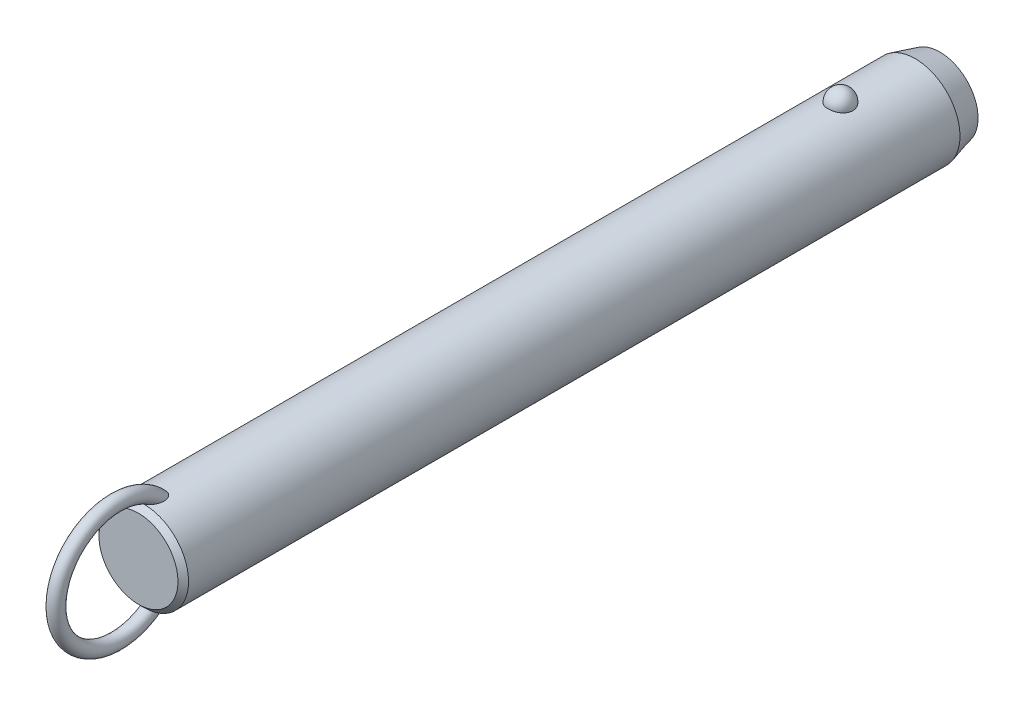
ISO-10303-21;
HEADER;
FILE_DESCRIPTION(('STEP AP214'),'2;1');
FILE_NAME('part.step','',(''),(''),'','','');
FILE_SCHEMA(('AUTOMOTIVE_DESIGN { 1 0 10303 214 1 1 1 1 }'));
ENDSEC;
DATA;
#1=APPLICATION_CONTEXT('core data for automotive mechanical design processes');
#2=APPLICATION_PROTOCOL_DEFINITION('international standard','automotive_design',2000,#1);
#3=PRODUCT_CONTEXT('',#1,'mechanical');
#4=PRODUCT('Part','Part','',(#3));
#5=PRODUCT_RELATED_PRODUCT_CATEGORY('part','',(#4));
#6=PRODUCT_DEFINITION_FORMATION('','',#4);
#7=PRODUCT_DEFINITION_CONTEXT('part definition',#1,'design');
#8=PRODUCT_DEFINITION('design','',#6,#7);
#9=PRODUCT_DEFINITION_SHAPE('','',#8);
#10=(LENGTH_UNIT() NAMED_UNIT(*) SI_UNIT(.MILLI.,.METRE.));
#11=(NAMED_UNIT(*) PLANE_ANGLE_UNIT() SI_UNIT($,.RADIAN.));
#12=(NAMED_UNIT(*) SI_UNIT($,.STERADIAN.) SOLID_ANGLE_UNIT());
#13=UNCERTAINTY_MEASURE_WITH_UNIT(LENGTH_MEASURE(1.E-05),#10,'distance_accuracy_value','');
#14=(GEOMETRIC_REPRESENTATION_CONTEXT(3) GLOBAL_UNCERTAINTY_ASSIGNED_CONTEXT((#13)) GLOBAL_UNIT_ASSIGNED_CONTEXT((#10,
#11,#12)) REPRESENTATION_CONTEXT('',''));
#15=CARTESIAN_POINT('',(0.,0.,0.));
#16=DIRECTION('',(0.,0.,1.));
#17=DIRECTION('',(1.,0.,0.));
#18=AXIS2_PLACEMENT_3D('',#15,#16,#17);
#19=CARTESIAN_POINT('',(0.,0.,182.9));
#20=DIRECTION('',(0.,0.,-1.));
#21=DIRECTION('',(-1.,0.,0.));
#22=AXIS2_PLACEMENT_3D('',#19,#20,#21);
#23=CYLINDRICAL_SURFACE('',#22,12.7);
#24=CARTESIAN_POINT('',(3.46661256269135,12.2177165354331,-3.5));
#25=CARTESIAN_POINT('',(3.4666090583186,12.2177194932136,-3.30432790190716));
#26=CARTESIAN_POINT('',(3.45063567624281,12.2222841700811,-3.10861112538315));
#27=CARTESIAN_POINT('',(3.38712451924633,12.2400345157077,-2.72271899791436));
#28=CARTESIAN_POINT('',(3.33957415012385,12.2532236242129,-2.53254588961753));
#29=CARTESIAN_POINT('',(3.2141234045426,12.286724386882,-2.16324948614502));
#30=CARTESIAN_POINT('',(3.13623639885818,12.3070329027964,-1.98412136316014));
#31=CARTESIAN_POINT('',(2.95205930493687,12.3525018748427,-1.64180592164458));
#32=CARTESIAN_POINT('',(2.84577003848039,12.3776621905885,-1.47861814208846));
#33=CARTESIAN_POINT('',(2.60688050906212,12.4301712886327,-1.17190583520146));
#34=CARTESIAN_POINT('',(2.47415697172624,12.4575299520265,-1.02847897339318));
#35=CARTESIAN_POINT('',(2.18615174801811,12.5112810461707,-0.766177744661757));
#36=CARTESIAN_POINT('',(2.03087002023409,12.5376734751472,-0.647303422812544));
#37=CARTESIAN_POINT('',(1.70237334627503,12.5864761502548,-0.437732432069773));
#38=CARTESIAN_POINT('',(1.52920948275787,12.6088972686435,-0.34695830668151));
#39=CARTESIAN_POINT('',(1.16944170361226,12.6473352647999,-0.195750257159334));
#40=CARTESIAN_POINT('',(0.982839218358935,12.663352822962,-0.135313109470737));
#41=CARTESIAN_POINT('',(0.604961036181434,12.6869706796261,-0.0473241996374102));
#42=CARTESIAN_POINT('',(0.413823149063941,12.6947125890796,-0.0192185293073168));
#43=CARTESIAN_POINT('',(0.0293827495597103,12.7014203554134,0.00517254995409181));
#44=CARTESIAN_POINT('',(-0.163919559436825,12.7003870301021,0.00146092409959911));
#45=CARTESIAN_POINT('',(-0.544374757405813,12.689735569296,-0.0373939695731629));
#46=CARTESIAN_POINT('',(-0.731575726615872,12.6802364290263,-0.0721015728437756));
#47=CARTESIAN_POINT('',(-1.09733277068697,12.6538333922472,-0.171364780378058));
#48=CARTESIAN_POINT('',(-1.27588869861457,12.6369293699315,-0.23592089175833));
#49=CARTESIAN_POINT('',(-1.6204698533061,12.5973946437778,-0.393548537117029));
#50=CARTESIAN_POINT('',(-1.78641865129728,12.5747321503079,-0.48677898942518));
#51=CARTESIAN_POINT('',(-2.10030671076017,12.5261316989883,-0.699110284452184));
#52=CARTESIAN_POINT('',(-2.24824419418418,12.5001934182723,-0.818213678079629));
#53=CARTESIAN_POINT('',(-2.52491489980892,12.4472906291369,-1.08157124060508));
#54=CARTESIAN_POINT('',(-2.65324222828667,12.4203160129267,-1.22624992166));
#55=CARTESIAN_POINT('',(-2.88410007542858,12.3687509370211,-1.53528325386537));
#56=CARTESIAN_POINT('',(-2.98662883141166,12.3441606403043,-1.69963924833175));
#57=CARTESIAN_POINT('',(-3.16432417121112,12.2998199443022,-2.04548497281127));
#58=CARTESIAN_POINT('',(-3.23917525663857,12.2801261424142,-2.22714424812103));
#59=CARTESIAN_POINT('',(-3.35800573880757,12.248167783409,-2.6009138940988));
#60=CARTESIAN_POINT('',(-3.4019860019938,12.2359030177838,-2.79302397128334));
#61=CARTESIAN_POINT('',(-3.45784812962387,12.2202347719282,-3.18140279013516));
#62=CARTESIAN_POINT('',(-3.46986123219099,12.2167950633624,-3.37765118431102));
#63=CARTESIAN_POINT('',(-3.46186273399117,12.2190638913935,-3.76943689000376));
#64=CARTESIAN_POINT('',(-3.44185196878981,12.2247721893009,-3.96497421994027));
#65=CARTESIAN_POINT('',(-3.37048652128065,12.2446381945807,-4.34881728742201));
#66=CARTESIAN_POINT('',(-3.31928253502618,12.2587552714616,-4.53715319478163));
#67=CARTESIAN_POINT('',(-3.18693461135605,12.2938237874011,-4.90231727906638));
#68=CARTESIAN_POINT('',(-3.1057895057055,12.3147754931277,-5.07914500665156));
#69=CARTESIAN_POINT('',(-2.91506431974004,12.3613125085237,-5.4173205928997));
#70=CARTESIAN_POINT('',(-2.80533587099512,12.3869217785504,-5.57858147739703));
#71=CARTESIAN_POINT('',(-2.560414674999,12.4398525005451,-5.88013283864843));
#72=CARTESIAN_POINT('',(-2.42522099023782,12.4671740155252,-6.02042254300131));
#73=CARTESIAN_POINT('',(-2.1323357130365,12.5205965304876,-6.27662798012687));
#74=CARTESIAN_POINT('',(-1.97456596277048,12.5466928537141,-6.39245542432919));
#75=CARTESIAN_POINT('',(-1.64115839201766,12.5946384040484,-6.59583547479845));
#76=CARTESIAN_POINT('',(-1.46552179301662,12.6164879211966,-6.68339001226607));
#77=CARTESIAN_POINT('',(-1.10356050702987,12.6532533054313,-6.82682153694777));
#78=CARTESIAN_POINT('',(-0.917391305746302,12.6682500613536,-6.88306988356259));
#79=CARTESIAN_POINT('',(-0.537836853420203,12.6900288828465,-6.96386887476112));
#80=CARTESIAN_POINT('',(-0.344452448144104,12.6968119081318,-6.9884232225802));
#81=CARTESIAN_POINT('',(0.0402577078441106,12.7013667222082,-7.00496469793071));
#82=CARTESIAN_POINT('',(0.231556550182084,12.6993008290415,-6.99753844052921));
#83=CARTESIAN_POINT('',(0.610105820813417,12.6867505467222,-6.95166366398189));
#84=CARTESIAN_POINT('',(0.797356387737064,12.6762664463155,-6.91321620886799));
#85=CARTESIAN_POINT('',(1.16186657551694,12.6480587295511,-6.80658431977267));
#86=CARTESIAN_POINT('',(1.33915951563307,12.6303611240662,-6.73850666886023));
#87=CARTESIAN_POINT('',(1.67968518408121,12.5896027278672,-6.57450875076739));
#88=CARTESIAN_POINT('',(1.84291705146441,12.5665416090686,-6.47858678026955));
#89=CARTESIAN_POINT('',(2.15340192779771,12.5171072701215,-6.25982455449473));
#90=CARTESIAN_POINT('',(2.30037831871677,12.4906895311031,-6.13660186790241));
#91=CARTESIAN_POINT('',(2.5717412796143,12.4376567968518,-5.86739587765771));
#92=CARTESIAN_POINT('',(2.69612388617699,12.4110417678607,-5.72140858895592));
#93=CARTESIAN_POINT('',(2.92107785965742,12.360051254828,-5.40794137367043));
#94=CARTESIAN_POINT('',(3.02121329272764,12.3357209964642,-5.24014110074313));
#95=CARTESIAN_POINT('',(3.19236291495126,12.2925446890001,-4.8896986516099));
#96=CARTESIAN_POINT('',(3.26338839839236,12.2736965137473,-4.70706226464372));
#97=CARTESIAN_POINT('',(3.36788038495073,12.245404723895,-4.35469510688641));
#98=CARTESIAN_POINT('',(3.40484026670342,12.2351018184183,-4.18605935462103));
#99=CARTESIAN_POINT('',(3.45420764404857,12.2212564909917,-3.84496058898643));
#100=CARTESIAN_POINT('',(3.46661565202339,12.2177139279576,-3.67249765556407));
#101=CARTESIAN_POINT('',(3.46661256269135,12.2177165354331,-3.5));
#102=B_SPLINE_CURVE_WITH_KNOTS('',3,(#24,#25,#26,#27,#28,#29,#30,#31,#32,#33,#34,#35,#36,#37,
#38,#39,#40,#41,#42,#43,#44,#45,#46,#47,#48,#49,#50,#51,#52,#53,#54,#55,#56,#57,#58,#59,#60,#61,
#62,#63,#64,#65,#66,#67,#68,#69,#70,#71,#72,#73,#74,#75,#76,#77,#78,#79,#80,#81,#82,#83,#84,#85,
#86,#87,#88,#89,#90,#91,#92,#93,#94,#95,#96,#97,#98,#99,#100,#101),.UNSPECIFIED.,.T.,.F.,(4,2,2,
2,2,2,2,2,2,2,2,2,2,2,2,2,2,2,2,2,2,2,2,2,2,2,2,2,2,2,2,2,2,2,2,2,2,2,4),(0.,0.586396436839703,
1.17302689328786,1.7593990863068,2.34575431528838,2.93491084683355,3.52406845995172,
4.1115873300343,4.69904375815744,5.2762784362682,5.85345931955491,6.42265312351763,
6.99185659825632,7.56427334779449,8.136746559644,8.71981013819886,9.3029135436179,
9.89247258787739,10.4820150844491,11.0691335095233,11.6562366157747,12.2405256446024,
12.8248374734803,13.412244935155,13.9996740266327,14.5891883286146,15.1786623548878,
15.7609861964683,16.3432419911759,16.914863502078,17.4864654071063,18.056024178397,
18.6256177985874,19.2037609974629,19.7820055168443,20.3699810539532,20.9577282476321,
21.4746855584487,21.9916320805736),.UNSPECIFIED.);
#103=CARTESIAN_POINT('',(3.46661256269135,12.2177165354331,-3.5));
#104=VERTEX_POINT('',#103);
#105=EDGE_CURVE('E41',#104,#104,#102,.T.);
#106=ORIENTED_EDGE('',*,*,#105,.T.);
#107=EDGE_LOOP('',(#106));
#108=FACE_BOUND('',#107,.T.);
#109=CARTESIAN_POINT('',(0.,0.,194.1));
#110=DIRECTION('',(0.,0.,1.));
#111=DIRECTION('',(1.,0.,0.));
#112=AXIS2_PLACEMENT_3D('',#109,#110,#111);
#113=CIRCLE('',#112,12.7);
#114=CARTESIAN_POINT('',(12.7,0.,194.1));
#115=VERTEX_POINT('',#114);
#116=EDGE_CURVE('E10',#115,#115,#113,.F.);
#117=ORIENTED_EDGE('',*,*,#116,.T.);
#118=EDGE_LOOP('',(#117));
#119=FACE_BOUND('',#118,.T.);
#120=CARTESIAN_POINT('',(-0.548122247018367,-12.6881662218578,187.843218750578));
#121=CARTESIAN_POINT('',(-0.648865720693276,-12.6838128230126,187.877926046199));
#122=CARTESIAN_POINT('',(-0.7463984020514,-12.6783867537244,187.922042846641));
#123=CARTESIAN_POINT('',(-0.932125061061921,-12.666091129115,188.026764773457));
#124=CARTESIAN_POINT('',(-1.02030388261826,-12.6592192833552,188.087396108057));
#125=CARTESIAN_POINT('',(-1.18487740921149,-12.6448747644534,188.221847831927));
#126=CARTESIAN_POINT('',(-1.26134296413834,-12.637406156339,188.295582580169));
#127=CARTESIAN_POINT('',(-1.40231200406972,-12.6225412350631,188.453604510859));
#128=CARTESIAN_POINT('',(-1.46681470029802,-12.6151449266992,188.53789238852));
#129=CARTESIAN_POINT('',(-1.60714786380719,-12.5981718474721,188.749657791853));
#130=CARTESIAN_POINT('',(-1.677251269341,-12.588900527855,188.880962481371));
#131=CARTESIAN_POINT('',(-1.79536591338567,-12.5725964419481,189.153247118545));
#132=CARTESIAN_POINT('',(-1.84333535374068,-12.5655679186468,189.294244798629));
#133=CARTESIAN_POINT('',(-1.93422576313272,-12.5519624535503,189.637645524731));
#134=CARTESIAN_POINT('',(-1.96788773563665,-12.5466298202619,189.842557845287));
#135=CARTESIAN_POINT('',(-1.9941399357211,-12.542463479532,190.151760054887));
#136=CARTESIAN_POINT('',(-1.99883864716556,-12.5417153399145,190.255298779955));
#137=CARTESIAN_POINT('',(-2.00078003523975,-12.5414074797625,190.46245124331));
#138=CARTESIAN_POINT('',(-1.99802449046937,-12.5418474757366,190.566064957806));
#139=CARTESIAN_POINT('',(-1.98336733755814,-12.5441750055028,190.810320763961));
#140=CARTESIAN_POINT('',(-1.96851430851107,-12.5465291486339,190.950780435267));
#141=CARTESIAN_POINT('',(-1.92707089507,-12.5529612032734,191.229960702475));
#142=CARTESIAN_POINT('',(-1.90047458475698,-12.5570399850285,191.368680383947));
#143=CARTESIAN_POINT('',(-1.8361912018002,-12.5666008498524,191.64341135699));
#144=CARTESIAN_POINT('',(-1.79850828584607,-12.57208240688,191.779423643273));
#145=CARTESIAN_POINT('',(-1.71223796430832,-12.5841228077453,192.047842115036));
#146=CARTESIAN_POINT('',(-1.66365679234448,-12.5906810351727,192.180250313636));
#147=CARTESIAN_POINT('',(-1.57804503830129,-12.6016176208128,192.38548877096));
#148=CARTESIAN_POINT('',(-1.54477252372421,-12.6057501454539,192.459914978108));
#149=CARTESIAN_POINT('',(-1.47424480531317,-12.6141930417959,192.606839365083));
#150=CARTESIAN_POINT('',(-1.43699041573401,-12.6185033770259,192.679337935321));
#151=CARTESIAN_POINT('',(-1.35825795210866,-12.6272207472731,192.821892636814));
#152=CARTESIAN_POINT('',(-1.31678520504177,-12.6316276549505,192.891951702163));
#153=CARTESIAN_POINT('',(-1.22917793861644,-12.6404532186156,193.029070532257));
#154=CARTESIAN_POINT('',(-1.18304514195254,-12.6448718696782,193.096131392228));
#155=CARTESIAN_POINT('',(-1.07246411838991,-12.6547893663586,193.243874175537));
#156=CARTESIAN_POINT('',(-1.00642239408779,-12.6602600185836,193.323384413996));
#157=CARTESIAN_POINT('',(-0.864441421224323,-12.6707460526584,193.473169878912));
#158=CARTESIAN_POINT('',(-0.788516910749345,-12.6757620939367,193.543458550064));
#159=CARTESIAN_POINT('',(-0.652215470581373,-12.6833591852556,193.648680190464));
#160=CARTESIAN_POINT('',(-0.594982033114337,-12.6861973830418,193.687624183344));
#161=CARTESIAN_POINT('',(-0.475269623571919,-12.6912445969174,193.756489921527));
#162=CARTESIAN_POINT('',(-0.412800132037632,-12.6934547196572,193.786427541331));
#163=CARTESIAN_POINT('',(-0.295749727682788,-12.6966636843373,193.829756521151));
#164=CARTESIAN_POINT('',(-0.241949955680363,-12.6978134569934,193.845218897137));
#165=CARTESIAN_POINT('',(-0.13250810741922,-12.6994261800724,193.866884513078));
#166=CARTESIAN_POINT('',(-0.0768679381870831,-12.6998898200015,193.873097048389));
#167=CARTESIAN_POINT('',(0.0347696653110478,-12.7000752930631,193.875583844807));
#168=CARTESIAN_POINT('',(0.0907676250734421,-12.6997954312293,193.871835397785));
#169=CARTESIAN_POINT('',(0.201283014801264,-12.6985255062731,193.854788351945));
#170=CARTESIAN_POINT('',(0.255799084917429,-12.6975348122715,193.841481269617));
#171=CARTESIAN_POINT('',(0.376042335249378,-12.6946091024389,193.80203792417));
#172=CARTESIAN_POINT('',(0.440950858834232,-12.6924943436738,193.773449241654));
#173=CARTESIAN_POINT('',(0.565350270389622,-12.6875639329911,193.706323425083));
#174=CARTESIAN_POINT('',(0.62482897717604,-12.6847467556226,193.66776463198));
#175=CARTESIAN_POINT('',(0.77411610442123,-12.6767252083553,193.556949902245));
#176=CARTESIAN_POINT('',(0.859449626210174,-12.6711344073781,193.478760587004));
#177=CARTESIAN_POINT('',(1.0178944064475,-12.6593922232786,193.310943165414));
#178=CARTESIAN_POINT('',(1.090969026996,-12.653239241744,193.221282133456));
#179=CARTESIAN_POINT('',(1.2226879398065,-12.6411674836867,193.040265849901));
#180=CARTESIAN_POINT('',(1.28193986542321,-12.6352572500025,192.949345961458));
#181=CARTESIAN_POINT('',(1.3925977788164,-12.623540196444,192.762792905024));
#182=CARTESIAN_POINT('',(1.4439970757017,-12.6177334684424,192.667155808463));
#183=CARTESIAN_POINT('',(1.53972870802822,-12.6064093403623,192.472273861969));
#184=CARTESIAN_POINT('',(1.58405262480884,-12.6008922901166,192.373024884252));
#185=CARTESIAN_POINT('',(1.6660070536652,-12.5903187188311,192.171772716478));
#186=CARTESIAN_POINT('',(1.70363651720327,-12.5852622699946,192.069769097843));
#187=CARTESIAN_POINT('',(1.77545379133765,-12.5753406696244,191.854358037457));
#188=CARTESIAN_POINT('',(1.80903453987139,-12.5705328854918,191.740745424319));
#189=CARTESIAN_POINT('',(1.86844163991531,-12.5618400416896,191.511457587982));
#190=CARTESIAN_POINT('',(1.89426665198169,-12.5579551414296,191.395782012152));
#191=CARTESIAN_POINT('',(1.93785464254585,-12.5513030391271,191.163007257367));
#192=CARTESIAN_POINT('',(1.95562640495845,-12.5485346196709,191.045909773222));
#193=CARTESIAN_POINT('',(1.98264463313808,-12.5442934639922,190.810747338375));
#194=CARTESIAN_POINT('',(1.99189298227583,-12.5428204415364,190.69268260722));
#195=CARTESIAN_POINT('',(2.00416068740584,-12.540871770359,190.380622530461));
#196=CARTESIAN_POINT('',(1.99944433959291,-12.541631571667,190.186229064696));
#197=CARTESIAN_POINT('',(1.96113755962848,-12.5476846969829,189.800309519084));
#198=CARTESIAN_POINT('',(1.92758341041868,-12.5529723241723,189.608780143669));
#199=CARTESIAN_POINT('',(1.83934342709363,-12.5661532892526,189.282272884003));
#200=CARTESIAN_POINT('',(1.79215440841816,-12.5730485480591,189.14524997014));
#201=CARTESIAN_POINT('',(1.67676242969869,-12.588958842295,188.880445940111));
#202=CARTESIAN_POINT('',(1.60859050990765,-12.5979707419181,188.752651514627));
#203=CARTESIAN_POINT('',(1.46583832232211,-12.6152829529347,188.535800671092));
#204=CARTESIAN_POINT('',(1.39525727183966,-12.6233659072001,188.44410500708));
#205=CARTESIAN_POINT('',(1.23992594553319,-12.6395676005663,188.273485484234));
#206=CARTESIAN_POINT('',(1.15517932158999,-12.6476863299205,188.194558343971));
#207=CARTESIAN_POINT('',(0.971995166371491,-12.6630846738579,188.052643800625));
#208=CARTESIAN_POINT('',(0.873456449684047,-12.6703572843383,187.989784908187));
#209=CARTESIAN_POINT('',(0.66584770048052,-12.6829569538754,187.884487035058));
#210=CARTESIAN_POINT('',(0.556784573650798,-12.688285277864,187.842034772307));
#211=CARTESIAN_POINT('',(0.347338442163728,-12.6956226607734,187.784443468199));
#212=CARTESIAN_POINT('',(0.247759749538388,-12.6979816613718,187.766399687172));
#213=CARTESIAN_POINT('',(0.0470218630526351,-12.7003077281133,187.748600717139));
#214=CARTESIAN_POINT('',(-0.054135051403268,-12.7002779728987,187.748821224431));
#215=CARTESIAN_POINT('',(-0.221414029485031,-12.6982482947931,187.764363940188));
#216=CARTESIAN_POINT('',(-0.288055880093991,-12.6969033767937,187.774666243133));
#217=CARTESIAN_POINT('',(-0.419599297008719,-12.6932369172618,187.80313489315));
#218=CARTESIAN_POINT('',(-0.484501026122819,-12.6909154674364,187.821300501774));
#219=CARTESIAN_POINT('',(-0.548122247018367,-12.6881662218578,187.843218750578));
#220=B_SPLINE_CURVE_WITH_KNOTS('',3,(#120,#121,#122,#123,#124,#125,#126,#127,#128,#129,#130,
#131,#132,#133,#134,#135,#136,#137,#138,#139,#140,#141,#142,#143,#144,#145,#146,#147,#148,#149,
#150,#151,#152,#153,#154,#155,#156,#157,#158,#159,#160,#161,#162,#163,#164,#165,#166,#167,#168,
#169,#170,#171,#172,#173,#174,#175,#176,#177,#178,#179,#180,#181,#182,#183,#184,#185,#186,#187,
#188,#189,#190,#191,#192,#193,#194,#195,#196,#197,#198,#199,#200,#201,#202,#203,#204,#205,#206,
#207,#208,#209,#210,#211,#212,#213,#214,#215,#216,#217,#218,#219),.UNSPECIFIED.,.T.,.F.,(4,2,2,
2,2,2,2,2,2,2,2,2,2,2,2,2,2,2,2,2,2,2,2,2,2,2,2,2,2,2,2,2,2,2,2,2,2,2,2,2,2,2,2,2,2,2,2,2,2,4),
(0.,0.319642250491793,0.639794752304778,0.957927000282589,1.27608021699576,1.72100165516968,
2.16675988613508,2.78630021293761,3.09705782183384,3.4077412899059,3.83096358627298,
4.25439969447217,4.67767724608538,5.10071330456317,5.34550297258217,5.59024267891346,
5.83467707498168,6.079021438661,6.38891080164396,6.6983432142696,6.90560910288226,
7.1125074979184,7.27977315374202,7.44687060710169,7.61434932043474,7.78197685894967,
7.9936554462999,8.20579780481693,8.55147335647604,8.89816429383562,9.22375138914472,
9.54961437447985,9.87586224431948,10.2021611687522,10.5575872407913,10.913074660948,
11.2681734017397,11.6231936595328,12.2046601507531,12.7853961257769,13.2191642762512,
13.6522938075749,13.9989174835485,14.3454519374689,14.694676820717,15.0436740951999,
15.3457513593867,15.647426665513,15.8493051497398,16.0511646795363),.UNSPECIFIED.);
#221=CARTESIAN_POINT('',(-0.548122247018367,-12.6881662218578,187.843218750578));
#222=VERTEX_POINT('',#221);
#223=EDGE_CURVE('E59',#222,#222,#220,.T.);
#224=ORIENTED_EDGE('',*,*,#223,.T.);
#225=EDGE_LOOP('',(#224));
#226=FACE_BOUND('',#225,.T.);
#227=CARTESIAN_POINT('',(-0.548122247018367,12.6881662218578,187.843218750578));
#228=CARTESIAN_POINT('',(-0.459436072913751,12.6919968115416,187.812673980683));
#229=CARTESIAN_POINT('',(-0.368189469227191,12.6949996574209,187.789391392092));
#230=CARTESIAN_POINT('',(-0.183024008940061,12.6990186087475,187.758406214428));
#231=CARTESIAN_POINT('',(-0.0891049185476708,12.7000345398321,187.750704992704));
#232=CARTESIAN_POINT('',(0.0987147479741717,12.6999636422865,187.751245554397));
#233=CARTESIAN_POINT('',(0.192615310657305,12.6988761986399,187.759492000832));
#234=CARTESIAN_POINT('',(0.377658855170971,12.6947211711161,187.791551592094));
#235=CARTESIAN_POINT('',(0.468801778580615,12.6916535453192,187.815365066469));
#236=CARTESIAN_POINT('',(0.645809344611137,12.6838788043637,187.87745651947));
#237=CARTESIAN_POINT('',(0.731679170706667,12.6791733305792,187.915720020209));
#238=CARTESIAN_POINT('',(0.896315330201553,12.6686004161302,188.005120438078));
#239=CARTESIAN_POINT('',(0.975080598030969,12.6627328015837,188.056259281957));
#240=CARTESIAN_POINT('',(1.12963655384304,12.6499161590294,188.17367820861));
#241=CARTESIAN_POINT('',(1.20478673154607,12.6429194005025,188.240792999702));
#242=CARTESIAN_POINT('',(1.34448241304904,12.6288282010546,188.38522507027));
#243=CARTESIAN_POINT('',(1.40902173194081,12.621733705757,188.462548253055));
#244=CARTESIAN_POINT('',(1.55208211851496,12.6050877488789,188.659247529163));
#245=CARTESIAN_POINT('',(1.62510490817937,12.5957546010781,188.782654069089));
#246=CARTESIAN_POINT('',(1.7501904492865,12.5789823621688,189.039769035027));
#247=CARTESIAN_POINT('',(1.80221377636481,12.5715468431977,189.173496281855));
#248=CARTESIAN_POINT('',(1.90309965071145,12.5567434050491,189.498351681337));
#249=CARTESIAN_POINT('',(1.94342317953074,12.5504515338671,189.692161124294));
#250=CARTESIAN_POINT('',(1.99332997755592,12.5426147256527,190.08378810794));
#251=CARTESIAN_POINT('',(2.00285305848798,12.5410790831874,190.281612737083));
#252=CARTESIAN_POINT('',(1.99678999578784,12.5420407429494,190.616642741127));
#253=CARTESIAN_POINT('',(1.98794117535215,12.5434564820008,190.754042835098));
#254=CARTESIAN_POINT('',(1.95865119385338,12.5480641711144,191.027639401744));
#255=CARTESIAN_POINT('',(1.93820436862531,12.5512569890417,191.163835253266));
#256=CARTESIAN_POINT('',(1.88647896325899,12.5591352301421,191.434249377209));
#257=CARTESIAN_POINT('',(1.85518800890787,12.5638223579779,191.568465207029));
#258=CARTESIAN_POINT('',(1.78217886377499,12.5743868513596,191.833936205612));
#259=CARTESIAN_POINT('',(1.74046509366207,12.5802637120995,191.965192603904));
#260=CARTESIAN_POINT('',(1.66024095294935,12.5910571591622,192.186085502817));
#261=CARTESIAN_POINT('',(1.62434772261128,12.5957535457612,192.276690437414));
#262=CARTESIAN_POINT('',(1.54709009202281,12.6054762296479,192.455512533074));
#263=CARTESIAN_POINT('',(1.50572681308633,12.6105024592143,192.543730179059));
#264=CARTESIAN_POINT('',(1.41728020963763,12.620748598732,192.716932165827));
#265=CARTESIAN_POINT('',(1.37021377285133,12.625967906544,192.801925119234));
#266=CARTESIAN_POINT('',(1.26969620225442,12.6364721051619,192.968007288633));
#267=CARTESIAN_POINT('',(1.21624929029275,12.6417569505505,193.049099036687));
#268=CARTESIAN_POINT('',(1.10304413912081,12.6521331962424,193.204702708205));
#269=CARTESIAN_POINT('',(1.04340936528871,12.657226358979,193.279303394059));
#270=CARTESIAN_POINT('',(0.91591933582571,12.667090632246,193.421324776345));
#271=CARTESIAN_POINT('',(0.848064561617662,12.6718617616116,193.48874589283));
#272=CARTESIAN_POINT('',(0.717035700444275,12.67987711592,193.600624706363));
#273=CARTESIAN_POINT('',(0.655526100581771,12.6832377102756,193.646997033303));
#274=CARTESIAN_POINT('',(0.525985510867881,12.6892676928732,193.729619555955));
#275=CARTESIAN_POINT('',(0.457969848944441,12.6919386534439,193.765892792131));
#276=CARTESIAN_POINT('',(0.334859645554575,12.695691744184,193.816657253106));
#277=CARTESIAN_POINT('',(0.28111658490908,12.6970073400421,193.834373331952));
#278=CARTESIAN_POINT('',(0.171425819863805,12.6989609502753,193.860642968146));
#279=CARTESIAN_POINT('',(0.115480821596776,12.699599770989,193.869207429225));
#280=CARTESIAN_POINT('',(0.00272618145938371,12.7001251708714,193.876253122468));
#281=CARTESIAN_POINT('',(-0.0540859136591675,12.7000089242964,193.874696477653));
#282=CARTESIAN_POINT('',(-0.166544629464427,12.6990328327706,193.861600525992));
#283=CARTESIAN_POINT('',(-0.222190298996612,12.6981724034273,193.850053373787));
#284=CARTESIAN_POINT('',(-0.342018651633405,12.695562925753,193.814912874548));
#285=CARTESIAN_POINT('',(-0.405606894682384,12.6936676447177,193.78933225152));
#286=CARTESIAN_POINT('',(-0.527815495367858,12.6891754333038,193.728311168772));
#287=CARTESIAN_POINT('',(-0.58642538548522,12.6865770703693,193.692850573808));
#288=CARTESIAN_POINT('',(-0.731842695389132,12.6792129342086,193.591496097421));
#289=CARTESIAN_POINT('',(-0.814709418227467,12.6740767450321,193.5200395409));
#290=CARTESIAN_POINT('',(-0.969101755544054,12.6632083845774,193.36589007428));
#291=CARTESIAN_POINT('',(-1.04059564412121,12.6574746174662,193.283166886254));
#292=CARTESIAN_POINT('',(-1.16981116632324,12.6461638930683,193.115809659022));
#293=CARTESIAN_POINT('',(-1.22811369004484,12.6405994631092,193.031616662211));
#294=CARTESIAN_POINT('',(-1.33743405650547,12.6295007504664,192.858579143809));
#295=CARTESIAN_POINT('',(-1.38844577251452,12.6239664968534,192.769730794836));
#296=CARTESIAN_POINT('',(-1.48400702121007,12.6130898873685,192.588389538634));
#297=CARTESIAN_POINT('',(-1.52854232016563,12.6077479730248,192.495889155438));
#298=CARTESIAN_POINT('',(-1.61150113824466,12.5974127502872,192.308160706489));
#299=CARTESIAN_POINT('',(-1.64992317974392,12.5924195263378,192.212931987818));
#300=CARTESIAN_POINT('',(-1.73468589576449,12.581070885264,191.98289362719));
#301=CARTESIAN_POINT('',(-1.77831261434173,12.5749388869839,191.847066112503));
#302=CARTESIAN_POINT('',(-1.85439734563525,12.5639437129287,191.572212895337));
#303=CARTESIAN_POINT('',(-1.88684994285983,12.5590811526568,191.433185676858));
#304=CARTESIAN_POINT('',(-1.94008483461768,12.550968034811,191.15309235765));
#305=CARTESIAN_POINT('',(-1.96088706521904,12.5477147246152,191.012030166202));
#306=CARTESIAN_POINT('',(-1.99000539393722,12.5431291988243,190.728668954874));
#307=CARTESIAN_POINT('',(-1.99832911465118,12.5417958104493,190.586370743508));
#308=CARTESIAN_POINT('',(-2.00166624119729,12.5412674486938,190.257627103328));
#309=CARTESIAN_POINT('',(-1.99178843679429,12.5428579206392,190.071088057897));
#310=CARTESIAN_POINT('',(-1.94455183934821,12.5502731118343,189.70162404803));
#311=CARTESIAN_POINT('',(-1.90724032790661,12.5560905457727,189.518693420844));
#312=CARTESIAN_POINT('',(-1.81330718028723,12.5699462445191,189.204848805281));
#313=CARTESIAN_POINT('',(-1.76338820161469,12.5771273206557,189.071910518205));
#314=CARTESIAN_POINT('',(-1.64305018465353,12.593414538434,188.815681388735));
#315=CARTESIAN_POINT('',(-1.57265346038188,12.6025185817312,188.692380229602));
#316=CARTESIAN_POINT('',(-1.42634956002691,12.6198178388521,188.483564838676));
#317=CARTESIAN_POINT('',(-1.35423772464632,12.6278405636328,188.395384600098));
#318=CARTESIAN_POINT('',(-1.19645664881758,12.6437632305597,188.232107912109));
#319=CARTESIAN_POINT('',(-1.11080536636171,12.6516633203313,188.156994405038));
#320=CARTESIAN_POINT('',(-0.947219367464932,12.6648319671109,188.037811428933));
#321=CARTESIAN_POINT('',(-0.871624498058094,12.670300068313,187.990541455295));
#322=CARTESIAN_POINT('',(-0.7141618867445,12.6801492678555,187.9077413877));
#323=CARTESIAN_POINT('',(-0.632295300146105,12.684530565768,187.87220913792));
#324=CARTESIAN_POINT('',(-0.548122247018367,12.6881662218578,187.843218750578));
#325=B_SPLINE_CURVE_WITH_KNOTS('',3,(#227,#228,#229,#230,#231,#232,#233,#234,#235,#236,#237,
#238,#239,#240,#241,#242,#243,#244,#245,#246,#247,#248,#249,#250,#251,#252,#253,#254,#255,#256,
#257,#258,#259,#260,#261,#262,#263,#264,#265,#266,#267,#268,#269,#270,#271,#272,#273,#274,#275,
#276,#277,#278,#279,#280,#281,#282,#283,#284,#285,#286,#287,#288,#289,#290,#291,#292,#293,#294,
#295,#296,#297,#298,#299,#300,#301,#302,#303,#304,#305,#306,#307,#308,#309,#310,#311,#312,#313,
#314,#315,#316,#317,#318,#319,#320,#321,#322,#323,#324),.UNSPECIFIED.,.T.,.F.,(4,2,2,2,2,2,2,2,
2,2,2,2,2,2,2,2,2,2,2,2,2,2,2,2,2,2,2,2,2,2,2,2,2,2,2,2,2,2,2,2,2,2,2,2,2,2,2,2,4),(0.,
0.281328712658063,0.562682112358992,0.844117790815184,1.12555942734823,1.40671982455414,
1.68792232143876,1.98972294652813,2.29169886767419,2.72039860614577,3.14989948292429,
3.74084916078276,4.33295293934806,4.74554109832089,5.15833092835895,5.57159335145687,
5.98468079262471,6.27722775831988,6.56971484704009,6.86135609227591,7.15280542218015,
7.43927407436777,7.72572595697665,7.95635862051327,8.18646071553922,8.35559393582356,
8.52452541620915,8.69408946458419,8.86378678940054,9.06834348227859,9.27332014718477,
9.60010414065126,9.92778432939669,10.2350252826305,10.5425229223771,10.8506864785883,
11.15892440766,11.5867893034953,12.0148612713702,12.4421984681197,12.8692745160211,
13.4279365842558,13.9856380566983,14.4107062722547,14.835313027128,15.1765567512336,
15.517351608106,15.7844129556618,16.051425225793),.UNSPECIFIED.);
#326=CARTESIAN_POINT('',(-0.548122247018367,12.6881662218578,187.843218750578));
#327=VERTEX_POINT('',#326);
#328=EDGE_CURVE('E67',#327,#327,#325,.T.);
#329=ORIENTED_EDGE('',*,*,#328,.T.);
#330=EDGE_LOOP('',(#329));
#331=FACE_BOUND('',#330,.T.);
#332=CARTESIAN_POINT('',(0.,0.,-24.6999999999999));
#333=DIRECTION('',(0.,0.,-1.));
#334=DIRECTION('',(-1.,0.,0.));
#335=AXIS2_PLACEMENT_3D('',#332,#333,#334);
#336=CIRCLE('',#335,12.7);
#337=CARTESIAN_POINT('',(-12.7,0.,-24.6999999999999));
#338=VERTEX_POINT('',#337);
#339=EDGE_CURVE('E56',#338,#338,#336,.F.);
#340=ORIENTED_EDGE('',*,*,#339,.T.);
#341=EDGE_LOOP('',(#340));
#342=FACE_BOUND('',#341,.T.);
#343=ADVANCED_FACE('F37',(#108,#119,#226,#331,#342),#23,.T.);
#344=CARTESIAN_POINT('',(0.,0.,-31.7));
#345=DIRECTION('',(0.,0.,-1.));
#346=DIRECTION('',(-1.,0.,0.));
#347=AXIS2_PLACEMENT_3D('',#344,#345,#346);
#348=PLANE('',#347);
#349=CARTESIAN_POINT('',(0.,0.,-31.7));
#350=DIRECTION('',(0.,0.,-1.));
#351=DIRECTION('',(-1.,0.,0.));
#352=AXIS2_PLACEMENT_3D('',#349,#350,#351);
#353=CIRCLE('',#352,10.8243556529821);
#354=CARTESIAN_POINT('',(-10.8243556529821,0.,-31.7));
#355=VERTEX_POINT('',#354);
#356=EDGE_CURVE('E66',#355,#355,#353,.T.);
#357=ORIENTED_EDGE('',*,*,#356,.T.);
#358=EDGE_LOOP('',(#357));
#359=FACE_BOUND('',#358,.T.);
#360=ADVANCED_FACE('F85',(#359),#348,.T.);
#361=CARTESIAN_POINT('',(0.,0.,-31.7));
#362=DIRECTION('',(0.,0.,1.));
#363=DIRECTION('',(1.,0.,0.));
#364=AXIS2_PLACEMENT_3D('',#361,#362,#363);
#365=CONICAL_SURFACE('',#364,10.8243556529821,0.261799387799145);
#366=ORIENTED_EDGE('',*,*,#339,.F.);
#367=EDGE_LOOP('',(#366));
#368=FACE_BOUND('',#367,.T.);
#369=ORIENTED_EDGE('',*,*,#356,.F.);
#370=EDGE_LOOP('',(#369));
#371=FACE_BOUND('',#370,.T.);
#372=ADVANCED_FACE('F83',(#368,#371),#365,.T.);
#373=CARTESIAN_POINT('',(0.,0.,195.6));
#374=DIRECTION('',(0.,0.,1.));
#375=DIRECTION('',(1.,0.,0.));
#376=AXIS2_PLACEMENT_3D('',#373,#374,#375);
#377=PLANE('',#376);
#378=CARTESIAN_POINT('',(0.,0.,195.6));
#379=DIRECTION('',(0.,0.,1.));
#380=DIRECTION('',(1.,0.,0.));
#381=AXIS2_PLACEMENT_3D('',#378,#379,#380);
#382=CIRCLE('',#381,11.2);
#383=CARTESIAN_POINT('',(11.2,0.,195.6));
#384=VERTEX_POINT('',#383);
#385=EDGE_CURVE('E50',#384,#384,#382,.T.);
#386=ORIENTED_EDGE('',*,*,#385,.T.);
#387=EDGE_LOOP('',(#386));
#388=FACE_BOUND('',#387,.T.);
#389=ADVANCED_FACE('F77',(#388),#377,.T.);
#390=CARTESIAN_POINT('',(0.,0.,201.95));
#391=DIRECTION('',(1.,0.,0.));
#392=DIRECTION('',(0.,0.,-1.));
#393=AXIS2_PLACEMENT_3D('',#390,#391,#392);
#394=TOROIDAL_SURFACE('',#393,17.05,2.);
#395=ORIENTED_EDGE('',*,*,#328,.F.);
#396=EDGE_LOOP('',(#395));
#397=FACE_BOUND('',#396,.T.);
#398=ORIENTED_EDGE('',*,*,#223,.F.);
#399=EDGE_LOOP('',(#398));
#400=FACE_BOUND('',#399,.T.);
#401=ADVANCED_FACE('F73',(#397,#400),#394,.T.);
#402=CARTESIAN_POINT('',(0.,0.,195.6));
#403=DIRECTION('',(0.,0.,-1.));
#404=DIRECTION('',(-1.,0.,0.));
#405=AXIS2_PLACEMENT_3D('',#402,#403,#404);
#406=CONICAL_SURFACE('',#405,11.2,0.785398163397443);
#407=ORIENTED_EDGE('',*,*,#116,.F.);
#408=EDGE_LOOP('',(#407));
#409=FACE_BOUND('',#408,.T.);
#410=ORIENTED_EDGE('',*,*,#385,.F.);
#411=EDGE_LOOP('',(#410));
#412=FACE_BOUND('',#411,.T.);
#413=ADVANCED_FACE('F39',(#409,#412),#406,.T.);
#414=CARTESIAN_POINT('',(0.,12.7,-3.5));
#415=DIRECTION('',(0.,1.,0.));
#416=DIRECTION('',(0.,0.,1.));
#417=AXIS2_PLACEMENT_3D('',#414,#415,#416);
#418=SPHERICAL_SURFACE('',#417,3.5);
#419=ORIENTED_EDGE('',*,*,#105,.F.);
#420=EDGE_LOOP('',(#419));
#421=FACE_BOUND('',#420,.T.);
#422=ADVANCED_FACE('F79',(#421),#418,.T.);
#423=CLOSED_SHELL('',(#343,#360,#372,#389,#401,#413,#422));
#424=MANIFOLD_SOLID_BREP('B2',#423);
#425=ADVANCED_BREP_SHAPE_REPRESENTATION('',(#18,#424),#14);
#426=SHAPE_DEFINITION_REPRESENTATION(#9,#425);
ENDSEC;
END-ISO-10303-21;
